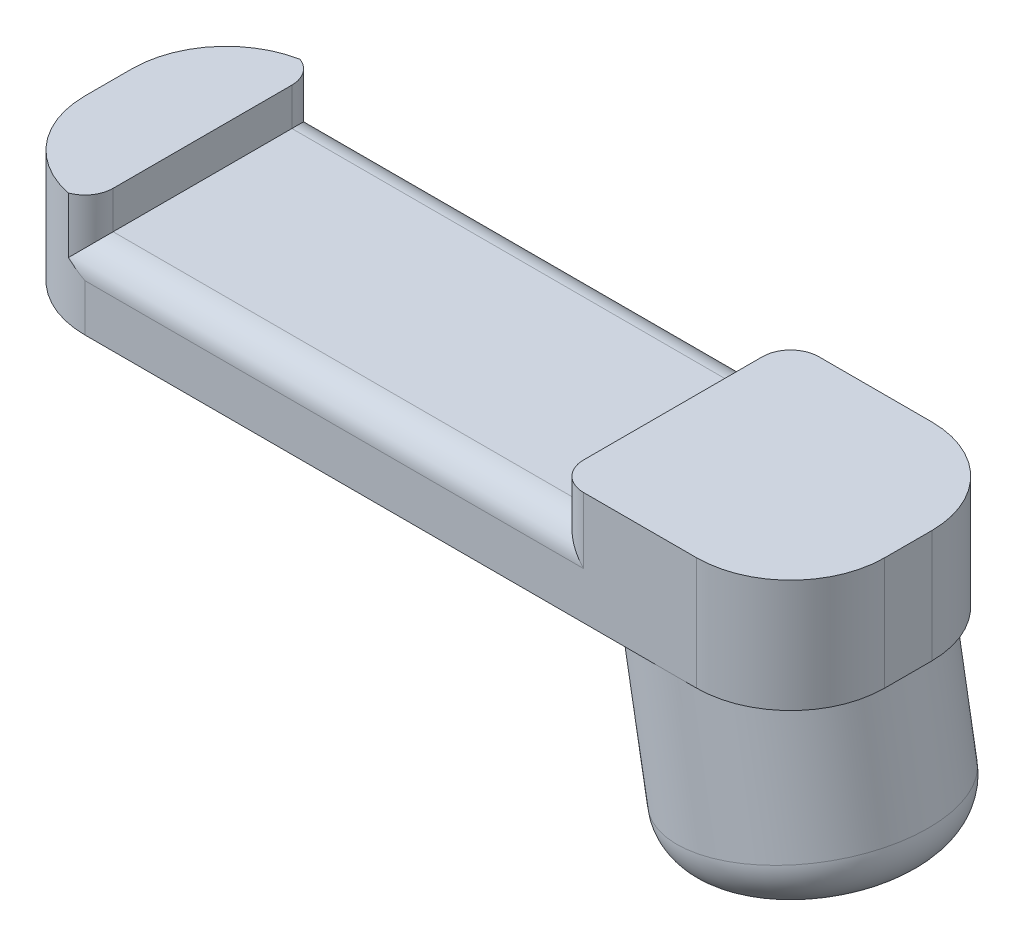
ISO-10303-21;
HEADER;
FILE_DESCRIPTION(('STEP AP214'),'2;1');
FILE_NAME('part.step','',(''),(''),'','','');
FILE_SCHEMA(('AUTOMOTIVE_DESIGN { 1 0 10303 214 1 1 1 1 }'));
ENDSEC;
DATA;
#1=APPLICATION_CONTEXT('core data for automotive mechanical design processes');
#2=APPLICATION_PROTOCOL_DEFINITION('international standard','automotive_design',2000,#1);
#3=PRODUCT_CONTEXT('',#1,'mechanical');
#4=PRODUCT('Part','Part','',(#3));
#5=PRODUCT_RELATED_PRODUCT_CATEGORY('part','',(#4));
#6=PRODUCT_DEFINITION_FORMATION('','',#4);
#7=PRODUCT_DEFINITION_CONTEXT('part definition',#1,'design');
#8=PRODUCT_DEFINITION('design','',#6,#7);
#9=PRODUCT_DEFINITION_SHAPE('','',#8);
#10=(LENGTH_UNIT() NAMED_UNIT(*) SI_UNIT(.MILLI.,.METRE.));
#11=(NAMED_UNIT(*) PLANE_ANGLE_UNIT() SI_UNIT($,.RADIAN.));
#12=(NAMED_UNIT(*) SI_UNIT($,.STERADIAN.) SOLID_ANGLE_UNIT());
#13=UNCERTAINTY_MEASURE_WITH_UNIT(LENGTH_MEASURE(1.E-05),#10,'distance_accuracy_value','');
#14=(GEOMETRIC_REPRESENTATION_CONTEXT(3) GLOBAL_UNCERTAINTY_ASSIGNED_CONTEXT((#13)) GLOBAL_UNIT_ASSIGNED_CONTEXT((#10,
#11,#12)) REPRESENTATION_CONTEXT('',''));
#15=CARTESIAN_POINT('',(0.,0.,0.));
#16=DIRECTION('',(0.,0.,1.));
#17=DIRECTION('',(1.,0.,0.));
#18=AXIS2_PLACEMENT_3D('',#15,#16,#17);
#19=CARTESIAN_POINT('',(-85.,-6.,12.5));
#20=DIRECTION('',(0.,-1.,0.));
#21=DIRECTION('',(0.,0.,-1.));
#22=AXIS2_PLACEMENT_3D('',#19,#20,#21);
#23=PLANE('',#22);
#24=DIRECTION('',(1.,0.,0.));
#25=VECTOR('',#24,1.);
#26=CARTESIAN_POINT('',(-85.,-5.99999999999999,-12.5));
#27=LINE('',#26,#25);
#28=CARTESIAN_POINT('',(-75.,-5.99999999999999,-12.5));
#29=VERTEX_POINT('',#28);
#30=CARTESIAN_POINT('',(-12.8694511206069,-5.99999999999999,-12.5));
#31=VERTEX_POINT('',#30);
#32=EDGE_CURVE('E197',#29,#31,#27,.T.);
#33=ORIENTED_EDGE('',*,*,#32,.T.);
#34=CARTESIAN_POINT('',(-12.8694511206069,-5.99999999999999,0.));
#35=DIRECTION('',(0.,-1.,0.));
#36=DIRECTION('',(1.,0.,0.));
#37=AXIS2_PLACEMENT_3D('',#34,#35,#36);
#38=ELLIPSE('',#37,12.6928326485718,12.5);
#39=CARTESIAN_POINT('',(-12.8694511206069,-6.,12.5));
#40=VERTEX_POINT('',#39);
#41=EDGE_CURVE('E83',#31,#40,#38,.F.);
#42=ORIENTED_EDGE('',*,*,#41,.T.);
#43=DIRECTION('',(1.,0.,0.));
#44=VECTOR('',#43,1.);
#45=CARTESIAN_POINT('',(-85.,-6.,12.5));
#46=LINE('',#45,#44);
#47=CARTESIAN_POINT('',(-75.,-6.,12.5));
#48=VERTEX_POINT('',#47);
#49=EDGE_CURVE('E195',#48,#40,#46,.T.);
#50=ORIENTED_EDGE('',*,*,#49,.F.);
#51=CARTESIAN_POINT('',(-75.,-5.99999999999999,2.5));
#52=DIRECTION('',(0.,-1.,0.));
#53=DIRECTION('',(0.,0.,-1.));
#54=AXIS2_PLACEMENT_3D('',#51,#52,#53);
#55=CIRCLE('',#54,10.);
#56=CARTESIAN_POINT('',(-85.,-5.99999999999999,2.5));
#57=VERTEX_POINT('',#56);
#58=EDGE_CURVE('E246',#48,#57,#55,.T.);
#59=ORIENTED_EDGE('',*,*,#58,.T.);
#60=DIRECTION('',(0.,0.,-1.));
#61=VECTOR('',#60,1.);
#62=CARTESIAN_POINT('',(-85.,-6.,12.5));
#63=LINE('',#62,#61);
#64=CARTESIAN_POINT('',(-85.,-5.99999999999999,-2.5));
#65=VERTEX_POINT('',#64);
#66=EDGE_CURVE('E219',#57,#65,#63,.T.);
#67=ORIENTED_EDGE('',*,*,#66,.T.);
#68=CARTESIAN_POINT('',(-75.,-5.99999999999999,-2.5));
#69=DIRECTION('',(0.,-1.,0.));
#70=DIRECTION('',(0.,0.,-1.));
#71=AXIS2_PLACEMENT_3D('',#68,#69,#70);
#72=CIRCLE('',#71,10.);
#73=EDGE_CURVE('E429',#65,#29,#72,.T.);
#74=ORIENTED_EDGE('',*,*,#73,.T.);
#75=EDGE_LOOP('',(#33,#42,#50,#59,#67,#74));
#76=FACE_BOUND('',#75,.T.);
#77=ADVANCED_FACE('F69',(#76),#23,.T.);
#78=CARTESIAN_POINT('',(-85.,6.,-12.5));
#79=DIRECTION('',(0.,1.,0.));
#80=DIRECTION('',(0.,0.,1.));
#81=AXIS2_PLACEMENT_3D('',#78,#79,#80);
#82=PLANE('',#81);
#83=DIRECTION('',(0.,0.,1.));
#84=VECTOR('',#83,1.);
#85=CARTESIAN_POINT('',(0.,6.,-12.5));
#86=LINE('',#85,#84);
#87=CARTESIAN_POINT('',(0.,6.,-2.5));
#88=VERTEX_POINT('',#87);
#89=CARTESIAN_POINT('',(0.,6.,2.5));
#90=VERTEX_POINT('',#89);
#91=EDGE_CURVE('E358',#88,#90,#86,.T.);
#92=ORIENTED_EDGE('',*,*,#91,.F.);
#93=CARTESIAN_POINT('',(-10.,6.,-2.5));
#94=DIRECTION('',(0.,1.,0.));
#95=DIRECTION('',(0.,0.,1.));
#96=AXIS2_PLACEMENT_3D('',#93,#94,#95);
#97=CIRCLE('',#96,10.);
#98=CARTESIAN_POINT('',(-9.99999999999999,6.,-12.5));
#99=VERTEX_POINT('',#98);
#100=EDGE_CURVE('E360',#88,#99,#97,.T.);
#101=ORIENTED_EDGE('',*,*,#100,.T.);
#102=DIRECTION('',(1.,0.,0.));
#103=VECTOR('',#102,1.);
#104=CARTESIAN_POINT('',(-85.,6.,-12.5));
#105=LINE('',#104,#103);
#106=CARTESIAN_POINT('',(-22.,6.,-12.5));
#107=VERTEX_POINT('',#106);
#108=EDGE_CURVE('E216',#107,#99,#105,.T.);
#109=ORIENTED_EDGE('',*,*,#108,.F.);
#110=CARTESIAN_POINT('',(-22.,6.,-9.5));
#111=DIRECTION('',(0.,1.,0.));
#112=DIRECTION('',(0.,0.,1.));
#113=AXIS2_PLACEMENT_3D('',#110,#111,#112);
#114=CIRCLE('',#113,3.);
#115=CARTESIAN_POINT('',(-25.,6.,-9.49999999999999));
#116=VERTEX_POINT('',#115);
#117=EDGE_CURVE('E422',#107,#116,#114,.T.);
#118=ORIENTED_EDGE('',*,*,#117,.T.);
#119=DIRECTION('',(0.,0.,-1.));
#120=VECTOR('',#119,1.);
#121=CARTESIAN_POINT('',(-25.,6.,12.5));
#122=LINE('',#121,#120);
#123=CARTESIAN_POINT('',(-25.,6.,9.5));
#124=VERTEX_POINT('',#123);
#125=EDGE_CURVE('E378',#124,#116,#122,.T.);
#126=ORIENTED_EDGE('',*,*,#125,.F.);
#127=CARTESIAN_POINT('',(-22.,6.,9.5));
#128=DIRECTION('',(0.,1.,0.));
#129=DIRECTION('',(0.,0.,1.));
#130=AXIS2_PLACEMENT_3D('',#127,#128,#129);
#131=CIRCLE('',#130,3.);
#132=CARTESIAN_POINT('',(-22.,6.,12.5));
#133=VERTEX_POINT('',#132);
#134=EDGE_CURVE('E420',#124,#133,#131,.T.);
#135=ORIENTED_EDGE('',*,*,#134,.T.);
#136=DIRECTION('',(1.,0.,0.));
#137=VECTOR('',#136,1.);
#138=CARTESIAN_POINT('',(-85.,6.,12.5));
#139=LINE('',#138,#137);
#140=CARTESIAN_POINT('',(-9.99999999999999,6.,12.5));
#141=VERTEX_POINT('',#140);
#142=EDGE_CURVE('E203',#133,#141,#139,.T.);
#143=ORIENTED_EDGE('',*,*,#142,.T.);
#144=CARTESIAN_POINT('',(-10.,6.,2.5));
#145=DIRECTION('',(0.,1.,0.));
#146=DIRECTION('',(0.,0.,1.));
#147=AXIS2_PLACEMENT_3D('',#144,#145,#146);
#148=CIRCLE('',#147,10.);
#149=EDGE_CURVE('E362',#141,#90,#148,.T.);
#150=ORIENTED_EDGE('',*,*,#149,.T.);
#151=EDGE_LOOP('',(#92,#101,#109,#118,#126,#135,#143,#150));
#152=FACE_BOUND('',#151,.T.);
#153=ADVANCED_FACE('F298',(#152),#82,.T.);
#154=CARTESIAN_POINT('',(-85.,-5.99999999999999,-12.5));
#155=DIRECTION('',(0.,0.,-1.));
#156=DIRECTION('',(-1.,0.,0.));
#157=AXIS2_PLACEMENT_3D('',#154,#155,#156);
#158=PLANE('',#157);
#159=ORIENTED_EDGE('',*,*,#108,.T.);
#160=DIRECTION('',(0.,1.,0.));
#161=VECTOR('',#160,1.);
#162=CARTESIAN_POINT('',(-9.99999999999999,-5.99999999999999,-12.5));
#163=LINE('',#162,#161);
#164=CARTESIAN_POINT('',(-9.99999999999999,-5.99999999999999,-12.5));
#165=VERTEX_POINT('',#164);
#166=EDGE_CURVE('E400',#99,#165,#163,.F.);
#167=ORIENTED_EDGE('',*,*,#166,.T.);
#168=EDGE_CURVE('E210',#31,#165,#27,.T.);
#169=ORIENTED_EDGE('',*,*,#168,.F.);
#170=ORIENTED_EDGE('',*,*,#32,.F.);
#171=DIRECTION('',(0.,1.,0.));
#172=VECTOR('',#171,1.);
#173=CARTESIAN_POINT('',(-75.,6.,-12.5));
#174=LINE('',#173,#172);
#175=CARTESIAN_POINT('',(-75.,-1.,-12.5));
#176=VERTEX_POINT('',#175);
#177=EDGE_CURVE('E262',#29,#176,#174,.T.);
#178=ORIENTED_EDGE('',*,*,#177,.T.);
#179=DIRECTION('',(-1.,0.,0.));
#180=VECTOR('',#179,1.);
#181=CARTESIAN_POINT('',(-85.,-1.,-12.5));
#182=LINE('',#181,#180);
#183=CARTESIAN_POINT('',(-22.,-1.,-12.5));
#184=VERTEX_POINT('',#183);
#185=EDGE_CURVE('E226',#176,#184,#182,.F.);
#186=ORIENTED_EDGE('',*,*,#185,.T.);
#187=DIRECTION('',(0.,1.,0.));
#188=VECTOR('',#187,1.);
#189=CARTESIAN_POINT('',(-22.,6.,-12.5));
#190=LINE('',#189,#188);
#191=EDGE_CURVE('E414',#184,#107,#190,.T.);
#192=ORIENTED_EDGE('',*,*,#191,.T.);
#193=EDGE_LOOP('',(#159,#167,#169,#170,#178,#186,#192));
#194=FACE_BOUND('',#193,.T.);
#195=ADVANCED_FACE('F295',(#194),#158,.T.);
#196=CARTESIAN_POINT('',(-9.99999999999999,-6.,12.5));
#197=VERTEX_POINT('',#196);
#198=EDGE_CURVE('E91',#40,#197,#46,.T.);
#199=ORIENTED_EDGE('',*,*,#198,.F.);
#200=EDGE_CURVE('E186',#40,#31,#38,.F.);
#201=ORIENTED_EDGE('',*,*,#200,.T.);
#202=ORIENTED_EDGE('',*,*,#168,.T.);
#203=CARTESIAN_POINT('',(-10.,-5.99999999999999,-2.5));
#204=DIRECTION('',(0.,-1.,0.));
#205=DIRECTION('',(0.,0.,-1.));
#206=AXIS2_PLACEMENT_3D('',#203,#204,#205);
#207=CIRCLE('',#206,10.);
#208=CARTESIAN_POINT('',(0.,-5.99999999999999,-2.5));
#209=VERTEX_POINT('',#208);
#210=EDGE_CURVE('E397',#165,#209,#207,.T.);
#211=ORIENTED_EDGE('',*,*,#210,.T.);
#212=DIRECTION('',(0.,0.,-1.));
#213=VECTOR('',#212,1.);
#214=CARTESIAN_POINT('',(0.,-6.,12.5));
#215=LINE('',#214,#213);
#216=CARTESIAN_POINT('',(0.,-5.99999999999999,2.5));
#217=VERTEX_POINT('',#216);
#218=EDGE_CURVE('E366',#217,#209,#215,.T.);
#219=ORIENTED_EDGE('',*,*,#218,.F.);
#220=CARTESIAN_POINT('',(-10.,-5.99999999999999,2.5));
#221=DIRECTION('',(0.,-1.,0.));
#222=DIRECTION('',(0.,0.,-1.));
#223=AXIS2_PLACEMENT_3D('',#220,#221,#222);
#224=CIRCLE('',#223,10.);
#225=EDGE_CURVE('E201',#217,#197,#224,.T.);
#226=ORIENTED_EDGE('',*,*,#225,.T.);
#227=EDGE_LOOP('',(#199,#201,#202,#211,#219,#226));
#228=FACE_BOUND('',#227,.T.);
#229=ADVANCED_FACE('F199',(#228),#23,.T.);
#230=CARTESIAN_POINT('',(-85.,6.,12.5));
#231=DIRECTION('',(0.,0.,1.));
#232=DIRECTION('',(1.,0.,0.));
#233=AXIS2_PLACEMENT_3D('',#230,#231,#232);
#234=PLANE('',#233);
#235=ORIENTED_EDGE('',*,*,#49,.T.);
#236=ORIENTED_EDGE('',*,*,#198,.T.);
#237=DIRECTION('',(0.,-1.,0.));
#238=VECTOR('',#237,1.);
#239=CARTESIAN_POINT('',(-9.99999999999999,6.,12.5));
#240=LINE('',#239,#238);
#241=EDGE_CURVE('E395',#197,#141,#240,.F.);
#242=ORIENTED_EDGE('',*,*,#241,.T.);
#243=ORIENTED_EDGE('',*,*,#142,.F.);
#244=DIRECTION('',(0.,1.,0.));
#245=VECTOR('',#244,1.);
#246=CARTESIAN_POINT('',(-22.,-1.,12.5));
#247=LINE('',#246,#245);
#248=CARTESIAN_POINT('',(-22.,-1.,12.5));
#249=VERTEX_POINT('',#248);
#250=EDGE_CURVE('E417',#133,#249,#247,.F.);
#251=ORIENTED_EDGE('',*,*,#250,.T.);
#252=DIRECTION('',(1.,0.,0.));
#253=VECTOR('',#252,1.);
#254=CARTESIAN_POINT('',(-85.,-1.,12.5));
#255=LINE('',#254,#253);
#256=CARTESIAN_POINT('',(-75.,-1.,12.5));
#257=VERTEX_POINT('',#256);
#258=EDGE_CURVE('E228',#249,#257,#255,.F.);
#259=ORIENTED_EDGE('',*,*,#258,.T.);
#260=DIRECTION('',(0.,-1.,0.));
#261=VECTOR('',#260,1.);
#262=CARTESIAN_POINT('',(-75.,-6.,12.5));
#263=LINE('',#262,#261);
#264=EDGE_CURVE('E209',#257,#48,#263,.T.);
#265=ORIENTED_EDGE('',*,*,#264,.T.);
#266=EDGE_LOOP('',(#235,#236,#242,#243,#251,#259,#265));
#267=FACE_BOUND('',#266,.T.);
#268=ADVANCED_FACE('F206',(#267),#234,.T.);
#269=CARTESIAN_POINT('',(-78.,6.,-9.5));
#270=DIRECTION('',(0.,1.,0.));
#271=DIRECTION('',(0.,0.,1.));
#272=AXIS2_PLACEMENT_3D('',#269,#270,#271);
#273=CIRCLE('',#272,3.);
#274=CARTESIAN_POINT('',(-75.,6.,-9.5));
#275=VERTEX_POINT('',#274);
#276=CARTESIAN_POINT('',(-76.9461316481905,6.,-12.3088007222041));
#277=VERTEX_POINT('',#276);
#278=EDGE_CURVE('E240',#275,#277,#273,.T.);
#279=ORIENTED_EDGE('',*,*,#278,.T.);
#280=CARTESIAN_POINT('',(-75.,6.,-2.5));
#281=DIRECTION('',(0.,1.,0.));
#282=DIRECTION('',(0.,0.,1.));
#283=AXIS2_PLACEMENT_3D('',#280,#281,#282);
#284=CIRCLE('',#283,10.);
#285=CARTESIAN_POINT('',(-85.,6.,-2.5));
#286=VERTEX_POINT('',#285);
#287=EDGE_CURVE('E432',#277,#286,#284,.T.);
#288=ORIENTED_EDGE('',*,*,#287,.T.);
#289=DIRECTION('',(0.,0.,1.));
#290=VECTOR('',#289,1.);
#291=CARTESIAN_POINT('',(-85.,6.,-12.5));
#292=LINE('',#291,#290);
#293=CARTESIAN_POINT('',(-85.,6.,2.5));
#294=VERTEX_POINT('',#293);
#295=EDGE_CURVE('E370',#286,#294,#292,.T.);
#296=ORIENTED_EDGE('',*,*,#295,.T.);
#297=CARTESIAN_POINT('',(-75.,6.,2.5));
#298=DIRECTION('',(0.,1.,0.));
#299=DIRECTION('',(0.,0.,1.));
#300=AXIS2_PLACEMENT_3D('',#297,#298,#299);
#301=CIRCLE('',#300,10.);
#302=CARTESIAN_POINT('',(-76.9461316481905,6.,12.3088007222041));
#303=VERTEX_POINT('',#302);
#304=EDGE_CURVE('E251',#294,#303,#301,.T.);
#305=ORIENTED_EDGE('',*,*,#304,.T.);
#306=CARTESIAN_POINT('',(-78.,6.,9.5));
#307=DIRECTION('',(0.,1.,0.));
#308=DIRECTION('',(0.,0.,1.));
#309=AXIS2_PLACEMENT_3D('',#306,#307,#308);
#310=CIRCLE('',#309,3.);
#311=CARTESIAN_POINT('',(-75.,6.,9.49999999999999));
#312=VERTEX_POINT('',#311);
#313=EDGE_CURVE('E230',#303,#312,#310,.T.);
#314=ORIENTED_EDGE('',*,*,#313,.T.);
#315=DIRECTION('',(0.,0.,1.));
#316=VECTOR('',#315,1.);
#317=CARTESIAN_POINT('',(-75.,6.,-12.5));
#318=LINE('',#317,#316);
#319=EDGE_CURVE('E198',#275,#312,#318,.T.);
#320=ORIENTED_EDGE('',*,*,#319,.F.);
#321=EDGE_LOOP('',(#279,#288,#296,#305,#314,#320));
#322=FACE_BOUND('',#321,.T.);
#323=ADVANCED_FACE('F300',(#322),#82,.T.);
#324=CARTESIAN_POINT('',(-85.,0.,0.));
#325=DIRECTION('',(1.,0.,0.));
#326=DIRECTION('',(0.,0.,-1.));
#327=AXIS2_PLACEMENT_3D('',#324,#325,#326);
#328=PLANE('',#327);
#329=ORIENTED_EDGE('',*,*,#295,.F.);
#330=DIRECTION('',(0.,1.,0.));
#331=VECTOR('',#330,1.);
#332=CARTESIAN_POINT('',(-85.,-5.99999999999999,-2.5));
#333=LINE('',#332,#331);
#334=EDGE_CURVE('E431',#286,#65,#333,.F.);
#335=ORIENTED_EDGE('',*,*,#334,.T.);
#336=ORIENTED_EDGE('',*,*,#66,.F.);
#337=DIRECTION('',(0.,-1.,0.));
#338=VECTOR('',#337,1.);
#339=CARTESIAN_POINT('',(-85.,6.,2.5));
#340=LINE('',#339,#338);
#341=EDGE_CURVE('E248',#57,#294,#340,.F.);
#342=ORIENTED_EDGE('',*,*,#341,.T.);
#343=EDGE_LOOP('',(#329,#335,#336,#342));
#344=FACE_BOUND('',#343,.T.);
#345=ADVANCED_FACE('F303',(#344),#328,.F.);
#346=CARTESIAN_POINT('',(0.,0.,0.));
#347=DIRECTION('',(1.,0.,0.));
#348=DIRECTION('',(0.,0.,-1.));
#349=AXIS2_PLACEMENT_3D('',#346,#347,#348);
#350=PLANE('',#349);
#351=ORIENTED_EDGE('',*,*,#218,.T.);
#352=DIRECTION('',(0.,1.,0.));
#353=VECTOR('',#352,1.);
#354=CARTESIAN_POINT('',(0.,0.,-2.5));
#355=LINE('',#354,#353);
#356=EDGE_CURVE('E405',#209,#88,#355,.T.);
#357=ORIENTED_EDGE('',*,*,#356,.T.);
#358=ORIENTED_EDGE('',*,*,#91,.T.);
#359=DIRECTION('',(0.,-1.,0.));
#360=VECTOR('',#359,1.);
#361=CARTESIAN_POINT('',(0.,0.,2.5));
#362=LINE('',#361,#360);
#363=EDGE_CURVE('E407',#90,#217,#362,.T.);
#364=ORIENTED_EDGE('',*,*,#363,.T.);
#365=EDGE_LOOP('',(#351,#357,#358,#364));
#366=FACE_BOUND('',#365,.T.);
#367=ADVANCED_FACE('F310',(#366),#350,.T.);
#368=CARTESIAN_POINT('',(-25.,2.,12.5));
#369=DIRECTION('',(1.,0.,0.));
#370=DIRECTION('',(0.,0.,-1.));
#371=AXIS2_PLACEMENT_3D('',#368,#369,#370);
#372=PLANE('',#371);
#373=DIRECTION('',(0.,0.,-1.));
#374=VECTOR('',#373,1.);
#375=CARTESIAN_POINT('',(-25.,2.,12.5));
#376=LINE('',#375,#374);
#377=CARTESIAN_POINT('',(-25.,2.,9.5));
#378=VERTEX_POINT('',#377);
#379=CARTESIAN_POINT('',(-25.,2.,-9.49999999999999));
#380=VERTEX_POINT('',#379);
#381=EDGE_CURVE('E367',#378,#380,#376,.T.);
#382=ORIENTED_EDGE('',*,*,#381,.F.);
#383=DIRECTION('',(0.,1.,0.));
#384=VECTOR('',#383,1.);
#385=CARTESIAN_POINT('',(-25.,6.,9.5));
#386=LINE('',#385,#384);
#387=EDGE_CURVE('E424',#378,#124,#386,.T.);
#388=ORIENTED_EDGE('',*,*,#387,.T.);
#389=ORIENTED_EDGE('',*,*,#125,.T.);
#390=DIRECTION('',(0.,1.,0.));
#391=VECTOR('',#390,1.);
#392=CARTESIAN_POINT('',(-25.,-1.,-9.5));
#393=LINE('',#392,#391);
#394=EDGE_CURVE('E427',#116,#380,#393,.F.);
#395=ORIENTED_EDGE('',*,*,#394,.T.);
#396=EDGE_LOOP('',(#382,#388,#389,#395));
#397=FACE_BOUND('',#396,.T.);
#398=ADVANCED_FACE('F313',(#397),#372,.F.);
#399=CARTESIAN_POINT('',(-75.,2.,-12.5));
#400=DIRECTION('',(-1.,0.,0.));
#401=DIRECTION('',(0.,0.,1.));
#402=AXIS2_PLACEMENT_3D('',#399,#400,#401);
#403=PLANE('',#402);
#404=DIRECTION('',(0.,0.,1.));
#405=VECTOR('',#404,1.);
#406=CARTESIAN_POINT('',(-75.,2.,-12.5));
#407=LINE('',#406,#405);
#408=CARTESIAN_POINT('',(-75.,2.,-9.5));
#409=VERTEX_POINT('',#408);
#410=CARTESIAN_POINT('',(-75.,2.,9.49999999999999));
#411=VERTEX_POINT('',#410);
#412=EDGE_CURVE('E372',#409,#411,#407,.T.);
#413=ORIENTED_EDGE('',*,*,#412,.F.);
#414=DIRECTION('',(0.,1.,0.));
#415=VECTOR('',#414,1.);
#416=CARTESIAN_POINT('',(-75.,6.,-9.5));
#417=LINE('',#416,#415);
#418=EDGE_CURVE('E237',#409,#275,#417,.T.);
#419=ORIENTED_EDGE('',*,*,#418,.T.);
#420=ORIENTED_EDGE('',*,*,#319,.T.);
#421=DIRECTION('',(0.,1.,0.));
#422=VECTOR('',#421,1.);
#423=CARTESIAN_POINT('',(-75.,-1.,9.5));
#424=LINE('',#423,#422);
#425=EDGE_CURVE('E232',#312,#411,#424,.F.);
#426=ORIENTED_EDGE('',*,*,#425,.T.);
#427=EDGE_LOOP('',(#413,#419,#420,#426));
#428=FACE_BOUND('',#427,.T.);
#429=ADVANCED_FACE('F318',(#428),#403,.F.);
#430=CARTESIAN_POINT('',(0.,2.,0.));
#431=DIRECTION('',(0.,1.,0.));
#432=DIRECTION('',(0.,0.,1.));
#433=AXIS2_PLACEMENT_3D('',#430,#431,#432);
#434=PLANE('',#433);
#435=ORIENTED_EDGE('',*,*,#381,.T.);
#436=DIRECTION('',(-1.,0.,0.));
#437=VECTOR('',#436,1.);
#438=CARTESIAN_POINT('',(0.,2.,-9.5));
#439=LINE('',#438,#437);
#440=EDGE_CURVE('E223',#380,#409,#439,.T.);
#441=ORIENTED_EDGE('',*,*,#440,.T.);
#442=ORIENTED_EDGE('',*,*,#412,.T.);
#443=DIRECTION('',(1.,0.,0.));
#444=VECTOR('',#443,1.);
#445=CARTESIAN_POINT('',(0.,2.,9.5));
#446=LINE('',#445,#444);
#447=EDGE_CURVE('E220',#411,#378,#446,.T.);
#448=ORIENTED_EDGE('',*,*,#447,.T.);
#449=EDGE_LOOP('',(#435,#441,#442,#448));
#450=FACE_BOUND('',#449,.T.);
#451=ADVANCED_FACE('F293',(#450),#434,.T.);
#452=CARTESIAN_POINT('',(0.,-1.,-9.5));
#453=DIRECTION('',(-1.,0.,0.));
#454=DIRECTION('',(0.,0.,1.));
#455=AXIS2_PLACEMENT_3D('',#452,#453,#454);
#456=CYLINDRICAL_SURFACE('',#455,3.);
#457=ORIENTED_EDGE('',*,*,#185,.F.);
#458=CARTESIAN_POINT('',(-76.9461316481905,0.0538683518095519,-12.3088007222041));
#459=CARTESIAN_POINT('',(-76.7858835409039,-0.0308755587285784,-12.34058694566));
#460=CARTESIAN_POINT('',(-76.6253754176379,-0.116527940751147,-12.3683591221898));
#461=CARTESIAN_POINT('',(-76.3038963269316,-0.289223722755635,-12.4159621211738));
#462=CARTESIAN_POINT('',(-76.1429252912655,-0.376267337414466,-12.4357917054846));
#463=CARTESIAN_POINT('',(-75.6607677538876,-0.638105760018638,-12.4833565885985));
#464=CARTESIAN_POINT('',(-75.3390534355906,-0.814293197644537,-12.4994207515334));
#465=CARTESIAN_POINT('',(-75.0116940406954,-0.993594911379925,-12.4999948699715));
#466=CARTESIAN_POINT('',(-75.0058469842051,-0.996797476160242,-12.499999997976));
#467=CARTESIAN_POINT('',(-75.,-1.,-12.5));
#468=B_SPLINE_CURVE_WITH_KNOTS('',3,(#458,#459,#460,#461,#462,#463,#464,#465,#466,#467),
.UNSPECIFIED.,.F.,.F.,(4,2,2,2,4),(0.,0.551986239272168,1.10405849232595,2.20378685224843,
2.22378685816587),.UNSPECIFIED.);
#469=CARTESIAN_POINT('',(-76.9461316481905,0.0538683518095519,-12.3088007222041));
#470=VERTEX_POINT('',#469);
#471=EDGE_CURVE('E282',#176,#470,#468,.F.);
#472=ORIENTED_EDGE('',*,*,#471,.T.);
#473=CARTESIAN_POINT('',(-78.,-1.,-9.5));
#474=DIRECTION('',(0.707106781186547,-0.707106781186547,0.));
#475=DIRECTION('',(-0.707106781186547,-0.707106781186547,0.));
#476=AXIS2_PLACEMENT_3D('',#473,#474,#475);
#477=ELLIPSE('',#476,4.24264068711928,3.);
#478=EDGE_CURVE('E243',#470,#409,#477,.T.);
#479=ORIENTED_EDGE('',*,*,#478,.T.);
#480=ORIENTED_EDGE('',*,*,#440,.F.);
#481=CARTESIAN_POINT('',(-22.,-1.,-9.5));
#482=DIRECTION('',(-0.707106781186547,-0.707106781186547,0.));
#483=DIRECTION('',(0.707106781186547,-0.707106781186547,0.));
#484=AXIS2_PLACEMENT_3D('',#481,#482,#483);
#485=ELLIPSE('',#484,4.24264068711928,3.);
#486=EDGE_CURVE('E409',#380,#184,#485,.T.);
#487=ORIENTED_EDGE('',*,*,#486,.T.);
#488=EDGE_LOOP('',(#457,#472,#479,#480,#487));
#489=FACE_BOUND('',#488,.T.);
#490=ADVANCED_FACE('F289',(#489),#456,.T.);
#491=CARTESIAN_POINT('',(0.,-1.,9.5));
#492=DIRECTION('',(1.,0.,0.));
#493=DIRECTION('',(0.,0.,-1.));
#494=AXIS2_PLACEMENT_3D('',#491,#492,#493);
#495=CYLINDRICAL_SURFACE('',#494,3.);
#496=CARTESIAN_POINT('',(-78.,-1.,9.5));
#497=DIRECTION('',(0.707106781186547,-0.707106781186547,0.));
#498=DIRECTION('',(-0.707106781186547,-0.707106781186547,0.));
#499=AXIS2_PLACEMENT_3D('',#496,#497,#498);
#500=ELLIPSE('',#499,4.24264068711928,3.);
#501=CARTESIAN_POINT('',(-76.9461316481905,0.0538683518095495,12.3088007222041));
#502=VERTEX_POINT('',#501);
#503=EDGE_CURVE('E234',#411,#502,#500,.T.);
#504=ORIENTED_EDGE('',*,*,#503,.T.);
#505=CARTESIAN_POINT('',(-76.9461316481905,0.0538683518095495,12.3088007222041));
#506=CARTESIAN_POINT('',(-76.7858835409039,-0.0308755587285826,12.34058694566));
#507=CARTESIAN_POINT('',(-76.6253754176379,-0.116527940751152,12.3683591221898));
#508=CARTESIAN_POINT('',(-76.3038963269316,-0.289223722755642,12.4159621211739));
#509=CARTESIAN_POINT('',(-76.1429252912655,-0.376267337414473,12.4357917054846));
#510=CARTESIAN_POINT('',(-75.6607677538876,-0.638105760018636,12.4833565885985));
#511=CARTESIAN_POINT('',(-75.3390534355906,-0.814293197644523,12.4994207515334));
#512=CARTESIAN_POINT('',(-75.0116940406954,-0.993594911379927,12.4999948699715));
#513=CARTESIAN_POINT('',(-75.0058469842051,-0.996797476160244,12.499999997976));
#514=CARTESIAN_POINT('',(-75.,-1.,12.5));
#515=B_SPLINE_CURVE_WITH_KNOTS('',3,(#505,#506,#507,#508,#509,#510,#511,#512,#513,#514),
.UNSPECIFIED.,.F.,.F.,(4,2,2,2,4),(0.,0.551986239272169,1.10405849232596,2.20378685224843,
2.22378685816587),.UNSPECIFIED.);
#516=EDGE_CURVE('E255',#502,#257,#515,.T.);
#517=ORIENTED_EDGE('',*,*,#516,.T.);
#518=ORIENTED_EDGE('',*,*,#258,.F.);
#519=CARTESIAN_POINT('',(-22.,-1.,9.5));
#520=DIRECTION('',(-0.707106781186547,-0.707106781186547,0.));
#521=DIRECTION('',(0.707106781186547,-0.707106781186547,0.));
#522=AXIS2_PLACEMENT_3D('',#519,#520,#521);
#523=ELLIPSE('',#522,4.24264068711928,3.);
#524=EDGE_CURVE('E412',#249,#378,#523,.T.);
#525=ORIENTED_EDGE('',*,*,#524,.T.);
#526=ORIENTED_EDGE('',*,*,#447,.F.);
#527=EDGE_LOOP('',(#504,#517,#518,#525,#526));
#528=FACE_BOUND('',#527,.T.);
#529=ADVANCED_FACE('F264',(#528),#495,.T.);
#530=CARTESIAN_POINT('',(-78.,6.,9.5));
#531=DIRECTION('',(0.,-1.,0.));
#532=DIRECTION('',(0.,0.,-1.));
#533=AXIS2_PLACEMENT_3D('',#530,#531,#532);
#534=CYLINDRICAL_SURFACE('',#533,3.);
#535=ORIENTED_EDGE('',*,*,#313,.F.);
#536=DIRECTION('',(0.,1.,0.));
#537=VECTOR('',#536,1.);
#538=CARTESIAN_POINT('',(-76.9461316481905,6.,12.3088007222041));
#539=LINE('',#538,#537);
#540=EDGE_CURVE('E253',#303,#502,#539,.F.);
#541=ORIENTED_EDGE('',*,*,#540,.T.);
#542=ORIENTED_EDGE('',*,*,#503,.F.);
#543=ORIENTED_EDGE('',*,*,#425,.F.);
#544=EDGE_LOOP('',(#535,#541,#542,#543));
#545=FACE_BOUND('',#544,.T.);
#546=ADVANCED_FACE('F451',(#545),#534,.T.);
#547=CARTESIAN_POINT('',(-78.,2.,-9.5));
#548=DIRECTION('',(0.,-1.,0.));
#549=DIRECTION('',(0.,0.,-1.));
#550=AXIS2_PLACEMENT_3D('',#547,#548,#549);
#551=CYLINDRICAL_SURFACE('',#550,3.);
#552=ORIENTED_EDGE('',*,*,#478,.F.);
#553=DIRECTION('',(0.,-1.,0.));
#554=VECTOR('',#553,1.);
#555=CARTESIAN_POINT('',(-76.9461316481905,0.0538683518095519,-12.3088007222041));
#556=LINE('',#555,#554);
#557=EDGE_CURVE('E287',#470,#277,#556,.F.);
#558=ORIENTED_EDGE('',*,*,#557,.T.);
#559=ORIENTED_EDGE('',*,*,#278,.F.);
#560=ORIENTED_EDGE('',*,*,#418,.F.);
#561=EDGE_LOOP('',(#552,#558,#559,#560));
#562=FACE_BOUND('',#561,.T.);
#563=ADVANCED_FACE('F274',(#562),#551,.T.);
#564=CARTESIAN_POINT('',(-75.,6.,2.5));
#565=DIRECTION('',(0.,1.,0.));
#566=DIRECTION('',(0.,0.,1.));
#567=AXIS2_PLACEMENT_3D('',#564,#565,#566);
#568=CYLINDRICAL_SURFACE('',#567,10.);
#569=ORIENTED_EDGE('',*,*,#304,.F.);
#570=ORIENTED_EDGE('',*,*,#341,.F.);
#571=ORIENTED_EDGE('',*,*,#58,.F.);
#572=ORIENTED_EDGE('',*,*,#264,.F.);
#573=ORIENTED_EDGE('',*,*,#516,.F.);
#574=ORIENTED_EDGE('',*,*,#540,.F.);
#575=EDGE_LOOP('',(#569,#570,#571,#572,#573,#574));
#576=FACE_BOUND('',#575,.T.);
#577=ADVANCED_FACE('F268',(#576),#568,.T.);
#578=CARTESIAN_POINT('',(-75.,-5.99999999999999,-2.5));
#579=DIRECTION('',(0.,-1.,0.));
#580=DIRECTION('',(0.,0.,-1.));
#581=AXIS2_PLACEMENT_3D('',#578,#579,#580);
#582=CYLINDRICAL_SURFACE('',#581,10.);
#583=ORIENTED_EDGE('',*,*,#73,.F.);
#584=ORIENTED_EDGE('',*,*,#334,.F.);
#585=ORIENTED_EDGE('',*,*,#287,.F.);
#586=ORIENTED_EDGE('',*,*,#557,.F.);
#587=ORIENTED_EDGE('',*,*,#471,.F.);
#588=ORIENTED_EDGE('',*,*,#177,.F.);
#589=EDGE_LOOP('',(#583,#584,#585,#586,#587,#588));
#590=FACE_BOUND('',#589,.T.);
#591=ADVANCED_FACE('F273',(#590),#582,.T.);
#592=CARTESIAN_POINT('',(-22.,2.,9.5));
#593=DIRECTION('',(0.,-1.,0.));
#594=DIRECTION('',(0.,0.,-1.));
#595=AXIS2_PLACEMENT_3D('',#592,#593,#594);
#596=CYLINDRICAL_SURFACE('',#595,3.);
#597=ORIENTED_EDGE('',*,*,#524,.F.);
#598=ORIENTED_EDGE('',*,*,#250,.F.);
#599=ORIENTED_EDGE('',*,*,#134,.F.);
#600=ORIENTED_EDGE('',*,*,#387,.F.);
#601=EDGE_LOOP('',(#597,#598,#599,#600));
#602=FACE_BOUND('',#601,.T.);
#603=ADVANCED_FACE('F279',(#602),#596,.T.);
#604=CARTESIAN_POINT('',(-22.,-5.99999999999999,-9.5));
#605=DIRECTION('',(0.,-1.,0.));
#606=DIRECTION('',(0.,0.,-1.));
#607=AXIS2_PLACEMENT_3D('',#604,#605,#606);
#608=CYLINDRICAL_SURFACE('',#607,3.);
#609=ORIENTED_EDGE('',*,*,#486,.F.);
#610=ORIENTED_EDGE('',*,*,#394,.F.);
#611=ORIENTED_EDGE('',*,*,#117,.F.);
#612=ORIENTED_EDGE('',*,*,#191,.F.);
#613=EDGE_LOOP('',(#609,#610,#611,#612));
#614=FACE_BOUND('',#613,.T.);
#615=ADVANCED_FACE('F468',(#614),#608,.T.);
#616=CARTESIAN_POINT('',(-10.,0.,-2.5));
#617=DIRECTION('',(0.,1.,0.));
#618=DIRECTION('',(0.,0.,1.));
#619=AXIS2_PLACEMENT_3D('',#616,#617,#618);
#620=CYLINDRICAL_SURFACE('',#619,10.);
#621=ORIENTED_EDGE('',*,*,#210,.F.);
#622=ORIENTED_EDGE('',*,*,#166,.F.);
#623=ORIENTED_EDGE('',*,*,#100,.F.);
#624=ORIENTED_EDGE('',*,*,#356,.F.);
#625=EDGE_LOOP('',(#621,#622,#623,#624));
#626=FACE_BOUND('',#625,.T.);
#627=ADVANCED_FACE('F475',(#626),#620,.T.);
#628=CARTESIAN_POINT('',(-10.,0.,2.5));
#629=DIRECTION('',(0.,-1.,0.));
#630=DIRECTION('',(0.,0.,-1.));
#631=AXIS2_PLACEMENT_3D('',#628,#629,#630);
#632=CYLINDRICAL_SURFACE('',#631,10.);
#633=ORIENTED_EDGE('',*,*,#149,.F.);
#634=ORIENTED_EDGE('',*,*,#241,.F.);
#635=ORIENTED_EDGE('',*,*,#225,.F.);
#636=ORIENTED_EDGE('',*,*,#363,.F.);
#637=EDGE_LOOP('',(#633,#634,#635,#636));
#638=FACE_BOUND('',#637,.T.);
#639=ADVANCED_FACE('F331',(#638),#632,.T.);
#640=CARTESIAN_POINT('',(-13.5529035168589,-2.12394885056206,0.));
#641=DIRECTION('',(0.173648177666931,-0.984807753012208,0.));
#642=DIRECTION('',(0.984807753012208,0.173648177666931,0.));
#643=AXIS2_PLACEMENT_3D('',#640,#641,#642);
#644=CYLINDRICAL_SURFACE('',#643,12.5);
#645=CARTESIAN_POINT('',(-10.1811031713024,-21.2463788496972,0.));
#646=DIRECTION('',(0.173648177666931,-0.984807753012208,0.));
#647=DIRECTION('',(0.984807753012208,0.173648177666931,0.));
#648=AXIS2_PLACEMENT_3D('',#645,#646,#647);
#649=CIRCLE('',#648,12.5);
#650=CARTESIAN_POINT('',(2.12899374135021,-19.0757766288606,0.));
#651=VERTEX_POINT('',#650);
#652=EDGE_CURVE('E12',#651,#651,#649,.F.);
#653=ORIENTED_EDGE('',*,*,#652,.T.);
#654=EDGE_LOOP('',(#653));
#655=FACE_BOUND('',#654,.T.);
#656=ORIENTED_EDGE('',*,*,#41,.F.);
#657=ORIENTED_EDGE('',*,*,#200,.F.);
#658=EDGE_LOOP('',(#656,#657));
#659=FACE_BOUND('',#658,.T.);
#660=ADVANCED_FACE('F187',(#655,#659),#644,.T.);
#661=CARTESIAN_POINT('',(-13.5529035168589,-2.12394885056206,0.));
#662=DIRECTION('',(0.173648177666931,-0.984807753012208,0.));
#663=DIRECTION('',(0.984807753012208,0.173648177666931,0.));
#664=AXIS2_PLACEMENT_3D('',#661,#662,#663);
#665=CYLINDRICAL_SURFACE('',#664,9.5);
#666=CARTESIAN_POINT('',(-12.8694511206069,-5.99999999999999,0.));
#667=DIRECTION('',(0.,-1.,0.));
#668=DIRECTION('',(1.,0.,0.));
#669=AXIS2_PLACEMENT_3D('',#666,#667,#668);
#670=ELLIPSE('',#669,9.64655281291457,9.5);
#671=CARTESIAN_POINT('',(-3.22289830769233,-5.99999999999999,0.));
#672=VERTEX_POINT('',#671);
#673=EDGE_CURVE('E77',#672,#672,#670,.F.);
#674=ORIENTED_EDGE('',*,*,#673,.T.);
#675=EDGE_LOOP('',(#674));
#676=FACE_BOUND('',#675,.T.);
#677=CARTESIAN_POINT('',(-9.38534725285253,-25.7593349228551,0.));
#678=DIRECTION('',(-0.173648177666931,0.984807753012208,0.));
#679=DIRECTION('',(-0.984807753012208,-0.173648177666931,0.));
#680=AXIS2_PLACEMENT_3D('',#677,#678,#679);
#681=CIRCLE('',#680,9.5);
#682=CARTESIAN_POINT('',(-18.7410209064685,-27.4089926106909,0.));
#683=VERTEX_POINT('',#682);
#684=EDGE_CURVE('E190',#683,#683,#681,.T.);
#685=ORIENTED_EDGE('',*,*,#684,.F.);
#686=EDGE_LOOP('',(#685));
#687=FACE_BOUND('',#686,.T.);
#688=ADVANCED_FACE('F330',(#676,#687),#665,.F.);
#689=CARTESIAN_POINT('',(-12.8694511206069,-5.99999999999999,0.));
#690=DIRECTION('',(0.,-1.,0.));
#691=DIRECTION('',(1.,0.,0.));
#692=AXIS2_PLACEMENT_3D('',#689,#690,#691);
#693=ELLIPSE('',#692,8.63112620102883,8.5);
#694=CARTESIAN_POINT('',(-4.23832491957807,-5.99999999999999,0.));
#695=VERTEX_POINT('',#694);
#696=EDGE_CURVE('E387',#695,#695,#693,.F.);
#697=ORIENTED_EDGE('',*,*,#696,.T.);
#698=EDGE_LOOP('',(#697));
#699=FACE_BOUND('',#698,.T.);
#700=ORIENTED_EDGE('',*,*,#673,.F.);
#701=EDGE_LOOP('',(#700));
#702=FACE_BOUND('',#701,.T.);
#703=ADVANCED_FACE('F309',(#699,#702),#23,.T.);
#704=CARTESIAN_POINT('',(-13.5529035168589,-2.12394885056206,0.));
#705=DIRECTION('',(0.173648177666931,-0.984807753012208,0.));
#706=DIRECTION('',(0.984807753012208,0.173648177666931,0.));
#707=AXIS2_PLACEMENT_3D('',#704,#705,#706);
#708=CYLINDRICAL_SURFACE('',#707,8.5);
#709=ORIENTED_EDGE('',*,*,#696,.F.);
#710=EDGE_LOOP('',(#709));
#711=FACE_BOUND('',#710,.T.);
#712=CARTESIAN_POINT('',(-9.38534725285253,-25.7593349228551,0.));
#713=DIRECTION('',(-0.173648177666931,0.984807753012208,0.));
#714=DIRECTION('',(-0.984807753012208,-0.173648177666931,0.));
#715=AXIS2_PLACEMENT_3D('',#712,#713,#714);
#716=CIRCLE('',#715,8.5);
#717=CARTESIAN_POINT('',(-17.7562131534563,-27.235344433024,0.));
#718=VERTEX_POINT('',#717);
#719=EDGE_CURVE('E388',#718,#718,#716,.T.);
#720=ORIENTED_EDGE('',*,*,#719,.T.);
#721=EDGE_LOOP('',(#720));
#722=FACE_BOUND('',#721,.T.);
#723=ADVANCED_FACE('F339',(#711,#722),#708,.T.);
#724=CARTESIAN_POINT('',(-9.38534725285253,-25.7593349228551,0.));
#725=DIRECTION('',(-0.173648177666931,0.984807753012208,0.));
#726=DIRECTION('',(-0.984807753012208,-0.173648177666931,0.));
#727=AXIS2_PLACEMENT_3D('',#724,#725,#726);
#728=PLANE('',#727);
#729=ORIENTED_EDGE('',*,*,#719,.F.);
#730=EDGE_LOOP('',(#729));
#731=FACE_BOUND('',#730,.T.);
#732=ADVANCED_FACE('F336',(#731),#728,.F.);
#733=CARTESIAN_POINT('',(-10.1811031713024,-21.2463788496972,0.));
#734=DIRECTION('',(0.173648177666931,-0.984807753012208,0.));
#735=DIRECTION('',(0.984807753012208,0.173648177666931,0.));
#736=AXIS2_PLACEMENT_3D('',#733,#734,#735);
#737=TOROIDAL_SURFACE('',#736,7.5,5.);
#738=ORIENTED_EDGE('',*,*,#684,.T.);
#739=EDGE_LOOP('',(#738));
#740=FACE_BOUND('',#739,.T.);
#741=ORIENTED_EDGE('',*,*,#652,.F.);
#742=EDGE_LOOP('',(#741));
#743=FACE_BOUND('',#742,.T.);
#744=ADVANCED_FACE('F71',(#740,#743),#737,.T.);
#745=CLOSED_SHELL('',(#77,#153,#195,#229,#268,#323,#345,#367,#398,#429,#451,#490,#529,#546,#563,
#577,#591,#603,#615,#627,#639,#660,#688,#703,#723,#732,#744));
#746=MANIFOLD_SOLID_BREP('B2',#745);
#747=ADVANCED_BREP_SHAPE_REPRESENTATION('',(#18,#746),#14);
#748=SHAPE_DEFINITION_REPRESENTATION(#9,#747);
ENDSEC;
END-ISO-10303-21;
